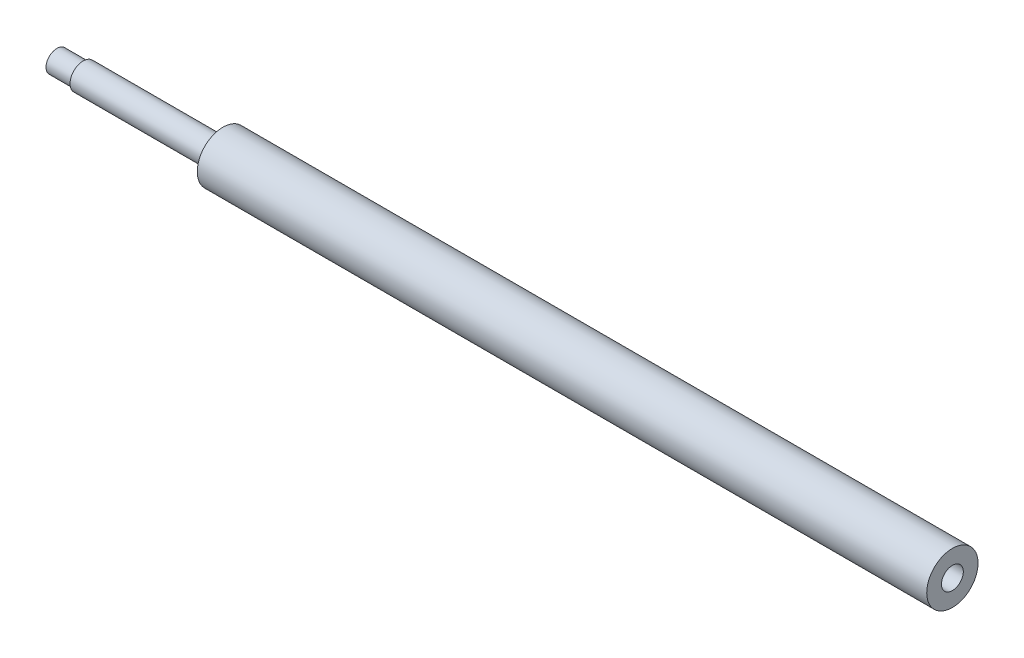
ISO-10303-21;
HEADER;
FILE_DESCRIPTION(('STEP AP214'),'2;1');
FILE_NAME('part.step','',(''),(''),'','','');
FILE_SCHEMA(('AUTOMOTIVE_DESIGN { 1 0 10303 214 1 1 1 1 }'));
ENDSEC;
DATA;
#1=APPLICATION_CONTEXT('core data for automotive mechanical design processes');
#2=APPLICATION_PROTOCOL_DEFINITION('international standard','automotive_design',2000,#1);
#3=PRODUCT_CONTEXT('',#1,'mechanical');
#4=PRODUCT('Part','Part','',(#3));
#5=PRODUCT_RELATED_PRODUCT_CATEGORY('part','',(#4));
#6=PRODUCT_DEFINITION_FORMATION('','',#4);
#7=PRODUCT_DEFINITION_CONTEXT('part definition',#1,'design');
#8=PRODUCT_DEFINITION('design','',#6,#7);
#9=PRODUCT_DEFINITION_SHAPE('','',#8);
#10=(LENGTH_UNIT() NAMED_UNIT(*) SI_UNIT(.MILLI.,.METRE.));
#11=(NAMED_UNIT(*) PLANE_ANGLE_UNIT() SI_UNIT($,.RADIAN.));
#12=(NAMED_UNIT(*) SI_UNIT($,.STERADIAN.) SOLID_ANGLE_UNIT());
#13=UNCERTAINTY_MEASURE_WITH_UNIT(LENGTH_MEASURE(1.E-05),#10,'distance_accuracy_value','');
#14=(GEOMETRIC_REPRESENTATION_CONTEXT(3) GLOBAL_UNCERTAINTY_ASSIGNED_CONTEXT((#13)) GLOBAL_UNIT_ASSIGNED_CONTEXT((#10,
#11,#12)) REPRESENTATION_CONTEXT('',''));
#15=CARTESIAN_POINT('',(0.,0.,0.));
#16=DIRECTION('',(0.,0.,1.));
#17=DIRECTION('',(1.,0.,0.));
#18=AXIS2_PLACEMENT_3D('',#15,#16,#17);
#19=CARTESIAN_POINT('',(0.,0.,0.));
#20=DIRECTION('',(1.,0.,0.));
#21=DIRECTION('',(0.,0.,-1.));
#22=AXIS2_PLACEMENT_3D('',#19,#20,#21);
#23=PLANE('',#22);
#24=CARTESIAN_POINT('',(0.,0.,0.));
#25=DIRECTION('',(-1.,0.,0.));
#26=DIRECTION('',(0.,0.,1.));
#27=AXIS2_PLACEMENT_3D('',#24,#25,#26);
#28=CIRCLE('',#27,2.49999999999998);
#29=CARTESIAN_POINT('',(0.,0.,2.49999999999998));
#30=VERTEX_POINT('',#29);
#31=EDGE_CURVE('E11',#30,#30,#28,.T.);
#32=ORIENTED_EDGE('',*,*,#31,.T.);
#33=EDGE_LOOP('',(#32));
#34=FACE_BOUND('',#33,.T.);
#35=ADVANCED_FACE('F34',(#34),#23,.F.);
#36=CARTESIAN_POINT('',(0.,0.,0.));
#37=DIRECTION('',(-1.,0.,0.));
#38=DIRECTION('',(0.,0.,1.));
#39=AXIS2_PLACEMENT_3D('',#36,#37,#38);
#40=CYLINDRICAL_SURFACE('',#39,2.49999999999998);
#41=ORIENTED_EDGE('',*,*,#31,.F.);
#42=EDGE_LOOP('',(#41));
#43=FACE_BOUND('',#42,.T.);
#44=CARTESIAN_POINT('',(6.,0.,0.));
#45=DIRECTION('',(-1.,0.,0.));
#46=DIRECTION('',(0.,0.,1.));
#47=AXIS2_PLACEMENT_3D('',#44,#45,#46);
#48=CIRCLE('',#47,2.49999999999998);
#49=CARTESIAN_POINT('',(6.,0.,2.49999999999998));
#50=VERTEX_POINT('',#49);
#51=EDGE_CURVE('E40',#50,#50,#48,.T.);
#52=ORIENTED_EDGE('',*,*,#51,.T.);
#53=EDGE_LOOP('',(#52));
#54=FACE_BOUND('',#53,.T.);
#55=ADVANCED_FACE('F71',(#43,#54),#40,.T.);
#56=CARTESIAN_POINT('',(6.,2.49999999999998,0.));
#57=DIRECTION('',(1.,0.,0.));
#58=DIRECTION('',(0.,0.,-1.));
#59=AXIS2_PLACEMENT_3D('',#56,#57,#58);
#60=PLANE('',#59);
#61=ORIENTED_EDGE('',*,*,#51,.F.);
#62=EDGE_LOOP('',(#61));
#63=FACE_BOUND('',#62,.T.);
#64=CARTESIAN_POINT('',(6.,0.,0.));
#65=DIRECTION('',(-1.,0.,0.));
#66=DIRECTION('',(0.,0.,1.));
#67=AXIS2_PLACEMENT_3D('',#64,#65,#66);
#68=CIRCLE('',#67,2.99999999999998);
#69=CARTESIAN_POINT('',(6.,0.,2.99999999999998));
#70=VERTEX_POINT('',#69);
#71=EDGE_CURVE('E66',#70,#70,#68,.T.);
#72=ORIENTED_EDGE('',*,*,#71,.T.);
#73=EDGE_LOOP('',(#72));
#74=FACE_BOUND('',#73,.T.);
#75=ADVANCED_FACE('F73',(#63,#74),#60,.F.);
#76=CARTESIAN_POINT('',(0.,0.,0.));
#77=DIRECTION('',(-1.,0.,0.));
#78=DIRECTION('',(0.,0.,1.));
#79=AXIS2_PLACEMENT_3D('',#76,#77,#78);
#80=CYLINDRICAL_SURFACE('',#79,2.99999999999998);
#81=ORIENTED_EDGE('',*,*,#71,.F.);
#82=EDGE_LOOP('',(#81));
#83=FACE_BOUND('',#82,.T.);
#84=CARTESIAN_POINT('',(38.,0.,0.));
#85=DIRECTION('',(-1.,0.,0.));
#86=DIRECTION('',(0.,0.,1.));
#87=AXIS2_PLACEMENT_3D('',#84,#85,#86);
#88=CIRCLE('',#87,2.99999999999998);
#89=CARTESIAN_POINT('',(38.,0.,2.99999999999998));
#90=VERTEX_POINT('',#89);
#91=EDGE_CURVE('E63',#90,#90,#88,.T.);
#92=ORIENTED_EDGE('',*,*,#91,.T.);
#93=EDGE_LOOP('',(#92));
#94=FACE_BOUND('',#93,.T.);
#95=ADVANCED_FACE('F76',(#83,#94),#80,.T.);
#96=CARTESIAN_POINT('',(38.,2.99999999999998,0.));
#97=DIRECTION('',(1.,0.,0.));
#98=DIRECTION('',(0.,0.,-1.));
#99=AXIS2_PLACEMENT_3D('',#96,#97,#98);
#100=PLANE('',#99);
#101=ORIENTED_EDGE('',*,*,#91,.F.);
#102=EDGE_LOOP('',(#101));
#103=FACE_BOUND('',#102,.T.);
#104=CARTESIAN_POINT('',(38.,0.,0.));
#105=DIRECTION('',(-1.,0.,0.));
#106=DIRECTION('',(0.,0.,1.));
#107=AXIS2_PLACEMENT_3D('',#104,#105,#106);
#108=CIRCLE('',#107,5.87499999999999);
#109=CARTESIAN_POINT('',(38.,0.,5.87499999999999));
#110=VERTEX_POINT('',#109);
#111=EDGE_CURVE('E60',#110,#110,#108,.T.);
#112=ORIENTED_EDGE('',*,*,#111,.T.);
#113=EDGE_LOOP('',(#112));
#114=FACE_BOUND('',#113,.T.);
#115=ADVANCED_FACE('F82',(#103,#114),#100,.F.);
#116=CARTESIAN_POINT('',(0.,0.,0.));
#117=DIRECTION('',(-1.,0.,0.));
#118=DIRECTION('',(0.,0.,1.));
#119=AXIS2_PLACEMENT_3D('',#116,#117,#118);
#120=CYLINDRICAL_SURFACE('',#119,5.87499999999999);
#121=ORIENTED_EDGE('',*,*,#111,.F.);
#122=EDGE_LOOP('',(#121));
#123=FACE_BOUND('',#122,.T.);
#124=CARTESIAN_POINT('',(205.,0.,0.));
#125=DIRECTION('',(-1.,0.,0.));
#126=DIRECTION('',(0.,0.,1.));
#127=AXIS2_PLACEMENT_3D('',#124,#125,#126);
#128=CIRCLE('',#127,5.87499999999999);
#129=CARTESIAN_POINT('',(205.,0.,5.87499999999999));
#130=VERTEX_POINT('',#129);
#131=EDGE_CURVE('E55',#130,#130,#128,.T.);
#132=ORIENTED_EDGE('',*,*,#131,.T.);
#133=EDGE_LOOP('',(#132));
#134=FACE_BOUND('',#133,.T.);
#135=ADVANCED_FACE('F88',(#123,#134),#120,.T.);
#136=CARTESIAN_POINT('',(205.,5.87499999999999,0.));
#137=DIRECTION('',(-1.,0.,0.));
#138=DIRECTION('',(0.,0.,1.));
#139=AXIS2_PLACEMENT_3D('',#136,#137,#138);
#140=PLANE('',#139);
#141=CARTESIAN_POINT('',(205.,0.,0.));
#142=DIRECTION('',(1.,0.,0.));
#143=DIRECTION('',(0.,0.,-1.));
#144=AXIS2_PLACEMENT_3D('',#141,#142,#143);
#145=CIRCLE('',#144,2.5);
#146=CARTESIAN_POINT('',(205.,0.,-2.5));
#147=VERTEX_POINT('',#146);
#148=EDGE_CURVE('E52',#147,#147,#145,.T.);
#149=ORIENTED_EDGE('',*,*,#148,.F.);
#150=EDGE_LOOP('',(#149));
#151=FACE_BOUND('',#150,.T.);
#152=ORIENTED_EDGE('',*,*,#131,.F.);
#153=EDGE_LOOP('',(#152));
#154=FACE_BOUND('',#153,.T.);
#155=ADVANCED_FACE('F94',(#151,#154),#140,.F.);
#156=CARTESIAN_POINT('',(205.,0.,0.));
#157=DIRECTION('',(1.,0.,0.));
#158=DIRECTION('',(0.,0.,-1.));
#159=AXIS2_PLACEMENT_3D('',#156,#157,#158);
#160=CYLINDRICAL_SURFACE('',#159,2.5);
#161=CARTESIAN_POINT('',(185.,0.,0.));
#162=DIRECTION('',(1.,0.,0.));
#163=DIRECTION('',(0.,0.,-1.));
#164=AXIS2_PLACEMENT_3D('',#161,#162,#163);
#165=CIRCLE('',#164,2.5);
#166=CARTESIAN_POINT('',(185.,0.,-2.5));
#167=VERTEX_POINT('',#166);
#168=EDGE_CURVE('E50',#167,#167,#165,.T.);
#169=ORIENTED_EDGE('',*,*,#168,.F.);
#170=EDGE_LOOP('',(#169));
#171=FACE_BOUND('',#170,.T.);
#172=ORIENTED_EDGE('',*,*,#148,.T.);
#173=EDGE_LOOP('',(#172));
#174=FACE_BOUND('',#173,.T.);
#175=ADVANCED_FACE('F46',(#171,#174),#160,.F.);
#176=CARTESIAN_POINT('',(185.,0.,0.));
#177=DIRECTION('',(1.,0.,0.));
#178=DIRECTION('',(0.,0.,-1.));
#179=AXIS2_PLACEMENT_3D('',#176,#177,#178);
#180=CONICAL_SURFACE('',#179,2.5,1.02974425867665);
#181=CARTESIAN_POINT('',(183.497848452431,0.,0.));
#182=VERTEX_POINT('',#181);
#183=VERTEX_LOOP('',#182);
#184=FACE_BOUND('',#183,.T.);
#185=ORIENTED_EDGE('',*,*,#168,.T.);
#186=EDGE_LOOP('',(#185));
#187=FACE_BOUND('',#186,.T.);
#188=ADVANCED_FACE('F43',(#184,#187),#180,.F.);
#189=CLOSED_SHELL('',(#35,#55,#75,#95,#115,#135,#155,#175,#188));
#190=MANIFOLD_SOLID_BREP('B2',#189);
#191=ADVANCED_BREP_SHAPE_REPRESENTATION('',(#18,#190),#14);
#192=SHAPE_DEFINITION_REPRESENTATION(#9,#191);
ENDSEC;
END-ISO-10303-21;
